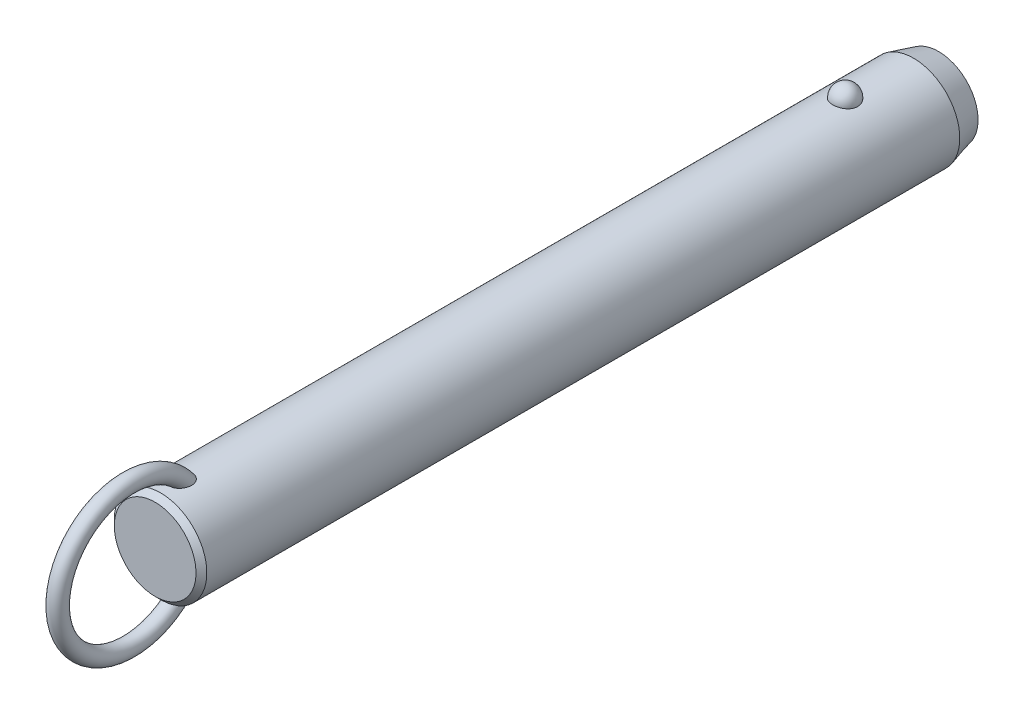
ISO-10303-21;
HEADER;
FILE_DESCRIPTION(('STEP AP214'),'2;1');
FILE_NAME('part.step','',(''),(''),'','','');
FILE_SCHEMA(('AUTOMOTIVE_DESIGN { 1 0 10303 214 1 1 1 1 }'));
ENDSEC;
DATA;
#1=APPLICATION_CONTEXT('core data for automotive mechanical design processes');
#2=APPLICATION_PROTOCOL_DEFINITION('international standard','automotive_design',2000,#1);
#3=PRODUCT_CONTEXT('',#1,'mechanical');
#4=PRODUCT('Part','Part','',(#3));
#5=PRODUCT_RELATED_PRODUCT_CATEGORY('part','',(#4));
#6=PRODUCT_DEFINITION_FORMATION('','',#4);
#7=PRODUCT_DEFINITION_CONTEXT('part definition',#1,'design');
#8=PRODUCT_DEFINITION('design','',#6,#7);
#9=PRODUCT_DEFINITION_SHAPE('','',#8);
#10=(LENGTH_UNIT() NAMED_UNIT(*) SI_UNIT(.MILLI.,.METRE.));
#11=(NAMED_UNIT(*) PLANE_ANGLE_UNIT() SI_UNIT($,.RADIAN.));
#12=(NAMED_UNIT(*) SI_UNIT($,.STERADIAN.) SOLID_ANGLE_UNIT());
#13=UNCERTAINTY_MEASURE_WITH_UNIT(LENGTH_MEASURE(1.E-05),#10,'distance_accuracy_value','');
#14=(GEOMETRIC_REPRESENTATION_CONTEXT(3) GLOBAL_UNCERTAINTY_ASSIGNED_CONTEXT((#13)) GLOBAL_UNIT_ASSIGNED_CONTEXT((#10,
#11,#12)) REPRESENTATION_CONTEXT('',''));
#15=CARTESIAN_POINT('',(0.,0.,0.));
#16=DIRECTION('',(0.,0.,1.));
#17=DIRECTION('',(1.,0.,0.));
#18=AXIS2_PLACEMENT_3D('',#15,#16,#17);
#19=CARTESIAN_POINT('',(0.,0.,149.9));
#20=DIRECTION('',(0.,0.,-1.));
#21=DIRECTION('',(-1.,0.,0.));
#22=AXIS2_PLACEMENT_3D('',#19,#20,#21);
#23=CYLINDRICAL_SURFACE('',#22,11.1);
#24=CARTESIAN_POINT('',(2.9724815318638,10.6945945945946,-2.99999999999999));
#25=CARTESIAN_POINT('',(2.97247830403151,10.6945972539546,-2.83225059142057));
#26=CARTESIAN_POINT('',(2.95876598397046,10.6984356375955,-2.66445972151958));
#27=CARTESIAN_POINT('',(2.90424529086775,10.7133624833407,-2.33362381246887));
#28=CARTESIAN_POINT('',(2.8634252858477,10.7244540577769,-2.17058084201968));
#29=CARTESIAN_POINT('',(2.75573657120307,10.7526272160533,-1.85396767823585));
#30=CARTESIAN_POINT('',(2.68887937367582,10.7697061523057,-1.70039333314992));
#31=CARTESIAN_POINT('',(2.53079696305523,10.8079438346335,-1.40691598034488));
#32=CARTESIAN_POINT('',(2.43957264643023,10.8291024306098,-1.26701246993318));
#33=CARTESIAN_POINT('',(2.23458150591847,10.8732541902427,-1.00409565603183));
#34=CARTESIAN_POINT('',(2.12071295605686,10.8962553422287,-0.881162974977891));
#35=CARTESIAN_POINT('',(1.87365402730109,10.9414421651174,-0.656352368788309));
#36=CARTESIAN_POINT('',(1.74046358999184,10.9636278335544,-0.55447450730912));
#37=CARTESIAN_POINT('',(1.45872188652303,11.0046495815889,-0.374872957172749));
#38=CARTESIAN_POINT('',(1.31021276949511,11.0234944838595,-0.297085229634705));
#39=CARTESIAN_POINT('',(1.00170030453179,11.0557957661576,-0.167529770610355));
#40=CARTESIAN_POINT('',(0.841698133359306,11.0692526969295,-0.115759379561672));
#41=CARTESIAN_POINT('',(0.517607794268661,11.0890932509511,-0.040392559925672));
#42=CARTESIAN_POINT('',(0.353633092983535,11.0955916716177,-0.0163383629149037));
#43=CARTESIAN_POINT('',(0.0238420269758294,11.1011989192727,0.00445177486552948));
#44=CARTESIAN_POINT('',(-0.141974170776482,11.1003084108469,0.00119017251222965));
#45=CARTESIAN_POINT('',(-0.468405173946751,11.0912990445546,-0.032323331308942));
#46=CARTESIAN_POINT('',(-0.629059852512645,11.0832767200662,-0.0622147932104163));
#47=CARTESIAN_POINT('',(-0.942937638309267,11.0609962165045,-0.147645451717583));
#48=CARTESIAN_POINT('',(-1.09616062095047,11.0467379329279,-0.20318507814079));
#49=CARTESIAN_POINT('',(-1.39181061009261,11.0134071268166,-0.338752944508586));
#50=CARTESIAN_POINT('',(-1.53417383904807,10.9943086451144,-0.418913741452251));
#51=CARTESIAN_POINT('',(-1.80342160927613,10.9533667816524,-0.601448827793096));
#52=CARTESIAN_POINT('',(-1.9303046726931,10.9315231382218,-0.703825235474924));
#53=CARTESIAN_POINT('',(-2.16747598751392,10.887005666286,-0.93009164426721));
#54=CARTESIAN_POINT('',(-2.27742774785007,10.8643239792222,-1.05433291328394));
#55=CARTESIAN_POINT('',(-2.47517316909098,10.8209886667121,-1.31966633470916));
#56=CARTESIAN_POINT('',(-2.56296538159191,10.8003351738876,-1.46075958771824));
#57=CARTESIAN_POINT('',(-2.71500300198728,10.7631304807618,-1.75753646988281));
#58=CARTESIAN_POINT('',(-2.77898901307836,10.7466250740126,-1.91335887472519));
#59=CARTESIAN_POINT('',(-2.88046189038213,10.7198747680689,-2.23391529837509));
#60=CARTESIAN_POINT('',(-2.91794947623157,10.709629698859,-2.39864907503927));
#61=CARTESIAN_POINT('',(-2.96537819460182,10.6965949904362,-2.73165170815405));
#62=CARTESIAN_POINT('',(-2.97542891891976,10.693775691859,-2.89990378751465));
#63=CARTESIAN_POINT('',(-2.96804271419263,10.6958279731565,-3.23575286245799));
#64=CARTESIAN_POINT('',(-2.95060646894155,10.7006993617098,-3.40334987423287));
#65=CARTESIAN_POINT('',(-2.88883358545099,10.71753912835,-3.73233906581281));
#66=CARTESIAN_POINT('',(-2.84462026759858,10.7294749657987,-3.893756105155));
#67=CARTESIAN_POINT('',(-2.73050447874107,10.7590797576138,-4.20667949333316));
#68=CARTESIAN_POINT('',(-2.66060103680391,10.7767489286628,-4.35818546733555));
#69=CARTESIAN_POINT('',(-2.49642559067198,10.8159599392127,-4.64785421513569));
#70=CARTESIAN_POINT('',(-2.40203047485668,10.8375211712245,-4.78594458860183));
#71=CARTESIAN_POINT('',(-2.19143488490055,10.8820570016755,-5.04410382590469));
#72=CARTESIAN_POINT('',(-2.07523364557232,10.9050316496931,-5.16417205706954));
#73=CARTESIAN_POINT('',(-1.82361254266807,10.9499219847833,-5.38334833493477));
#74=CARTESIAN_POINT('',(-1.68812945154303,10.9718338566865,-5.48238464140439));
#75=CARTESIAN_POINT('',(-1.40191298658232,11.0120611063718,-5.65618873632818));
#76=CARTESIAN_POINT('',(-1.25118062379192,11.0303767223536,-5.73095813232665));
#77=CARTESIAN_POINT('',(-0.940570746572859,11.0611653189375,-5.85334725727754));
#78=CARTESIAN_POINT('',(-0.780821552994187,11.0737044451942,-5.90127578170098));
#79=CARTESIAN_POINT('',(-0.455204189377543,11.0918598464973,-5.96992976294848));
#80=CARTESIAN_POINT('',(-0.289336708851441,11.0974768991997,-5.9906582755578));
#81=CARTESIAN_POINT('',(0.0406846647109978,11.1011307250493,-6.0041877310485));
#82=CARTESIAN_POINT('',(0.204817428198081,11.099299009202,-5.99747318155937));
#83=CARTESIAN_POINT('',(0.5295530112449,11.088551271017,-5.95740317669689));
#84=CARTESIAN_POINT('',(0.69015594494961,11.0796354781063,-5.92404858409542));
#85=CARTESIAN_POINT('',(1.0027760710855,11.0557204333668,-5.83180084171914));
#86=CARTESIAN_POINT('',(1.15482001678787,11.0407414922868,-5.77299291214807));
#87=CARTESIAN_POINT('',(1.44678373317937,11.0062913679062,-5.63147366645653));
#88=CARTESIAN_POINT('',(1.58670279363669,10.9868199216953,-5.548760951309));
#89=CARTESIAN_POINT('',(1.8527023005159,10.9451315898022,-5.36027644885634));
#90=CARTESIAN_POINT('',(1.97855158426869,10.9228788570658,-5.25418644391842));
#91=CARTESIAN_POINT('',(2.21080872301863,10.8782509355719,-5.02251354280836));
#92=CARTESIAN_POINT('',(2.31721312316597,10.8558757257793,-4.89692718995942));
#93=CARTESIAN_POINT('',(2.5094551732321,10.8130715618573,-4.62745408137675));
#94=CARTESIAN_POINT('',(2.59493284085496,10.7926798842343,-4.48330448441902));
#95=CARTESIAN_POINT('',(2.740862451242,10.7565495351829,-4.18236358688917));
#96=CARTESIAN_POINT('',(2.80132490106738,10.7408089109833,-4.02557762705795));
#97=CARTESIAN_POINT('',(2.88959070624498,10.7173718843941,-3.72475308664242));
#98=CARTESIAN_POINT('',(2.92062102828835,10.7088950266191,-3.58171216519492));
#99=CARTESIAN_POINT('',(2.96206765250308,10.6975052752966,-3.29245795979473));
#100=CARTESIAN_POINT('',(2.97248434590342,10.6945922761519,-3.14624473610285));
#101=CARTESIAN_POINT('',(2.9724815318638,10.6945945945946,-2.99999999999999));
#102=B_SPLINE_CURVE_WITH_KNOTS('',3,(#24,#25,#26,#27,#28,#29,#30,#31,#32,#33,#34,#35,#36,#37,
#38,#39,#40,#41,#42,#43,#44,#45,#46,#47,#48,#49,#50,#51,#52,#53,#54,#55,#56,#57,#58,#59,#60,#61,
#62,#63,#64,#65,#66,#67,#68,#69,#70,#71,#72,#73,#74,#75,#76,#77,#78,#79,#80,#81,#82,#83,#84,#85,
#86,#87,#88,#89,#90,#91,#92,#93,#94,#95,#96,#97,#98,#99,#100,#101),.UNSPECIFIED.,.T.,.F.,(4,2,2,
2,2,2,2,2,2,2,2,2,2,2,2,2,2,2,2,2,2,2,2,2,2,2,2,2,2,2,2,2,2,2,2,2,2,2,4),(0.,0.502722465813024,
1.00566079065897,1.5083769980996,2.01107471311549,2.51608392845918,3.02109467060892,
3.52475118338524,4.02835620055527,4.523518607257,5.0186364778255,5.50715297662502,
5.9956776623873,6.48688002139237,6.97812923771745,7.47814366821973,7.9781907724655,
8.48353712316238,8.9888697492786,9.49218093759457,9.99547960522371,10.4964777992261,
10.997494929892,11.5010810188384,12.0046847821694,12.5099796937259,13.0152411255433,
13.5145635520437,14.0138298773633,14.5043200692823,14.9947943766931,15.4836390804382,
15.9725123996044,16.4685040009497,16.9645836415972,17.4686765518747,17.972557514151,
18.410841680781,18.849117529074),.UNSPECIFIED.);
#103=CARTESIAN_POINT('',(2.9724815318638,10.6945945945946,-2.99999999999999));
#104=VERTEX_POINT('',#103);
#105=EDGE_CURVE('E41',#104,#104,#102,.T.);
#106=ORIENTED_EDGE('',*,*,#105,.T.);
#107=EDGE_LOOP('',(#106));
#108=FACE_BOUND('',#107,.T.);
#109=CARTESIAN_POINT('',(0.,0.,161.3));
#110=DIRECTION('',(0.,0.,1.));
#111=DIRECTION('',(1.,0.,0.));
#112=AXIS2_PLACEMENT_3D('',#109,#110,#111);
#113=CIRCLE('',#112,11.1);
#114=CARTESIAN_POINT('',(-11.1,0.,161.3));
#115=VERTEX_POINT('',#114);
#116=EDGE_CURVE('E10',#115,#115,#113,.F.);
#117=ORIENTED_EDGE('',*,*,#116,.T.);
#118=EDGE_LOOP('',(#117));
#119=FACE_BOUND('',#118,.T.);
#120=CARTESIAN_POINT('',(-0.564520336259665,-11.0856356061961,153.557815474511));
#121=CARTESIAN_POINT('',(-0.667202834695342,-11.0804062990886,153.591283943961));
#122=CARTESIAN_POINT('',(-0.766875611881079,-11.0738877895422,153.633835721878));
#123=CARTESIAN_POINT('',(-0.957284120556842,-11.0590576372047,153.735419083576));
#124=CARTESIAN_POINT('',(-1.04801616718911,-11.0507452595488,153.79445742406));
#125=CARTESIAN_POINT('',(-1.21800952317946,-11.0333016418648,153.926529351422));
#126=CARTESIAN_POINT('',(-1.29730805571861,-11.0241732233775,153.999515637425));
#127=CARTESIAN_POINT('',(-1.44337665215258,-11.0060026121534,154.157037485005));
#128=CARTESIAN_POINT('',(-1.51014622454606,-10.9969604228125,154.241573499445));
#129=CARTESIAN_POINT('',(-1.63454620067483,-10.9791841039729,154.425521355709));
#130=CARTESIAN_POINT('',(-1.69127003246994,-10.9705107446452,154.525549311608));
#131=CARTESIAN_POINT('',(-1.7898078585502,-10.9548648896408,154.732790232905));
#132=CARTESIAN_POINT('',(-1.83161214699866,-10.9478935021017,154.840007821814));
#133=CARTESIAN_POINT('',(-1.91557028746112,-10.9335803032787,155.105408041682));
#134=CARTESIAN_POINT('',(-1.95040620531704,-10.9273269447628,155.265980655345));
#135=CARTESIAN_POINT('',(-1.99388326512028,-10.9194709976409,155.590697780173));
#136=CARTESIAN_POINT('',(-2.00248051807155,-10.9178762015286,155.754847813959));
#137=CARTESIAN_POINT('',(-1.99551615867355,-10.9191578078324,156.124650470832));
#138=CARTESIAN_POINT('',(-1.9732206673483,-10.9232807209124,156.330191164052));
#139=CARTESIAN_POINT('',(-1.9152976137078,-10.9335244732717,156.633595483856));
#140=CARTESIAN_POINT('',(-1.89184575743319,-10.9376266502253,156.734088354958));
#141=CARTESIAN_POINT('',(-1.83700674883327,-10.9469720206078,156.932855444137));
#142=CARTESIAN_POINT('',(-1.80562070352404,-10.9522150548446,157.031129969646));
#143=CARTESIAN_POINT('',(-1.73463055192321,-10.9636837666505,157.225914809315));
#144=CARTESIAN_POINT('',(-1.69493416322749,-10.9699202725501,157.322390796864));
#145=CARTESIAN_POINT('',(-1.60745141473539,-10.9830806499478,157.511626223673));
#146=CARTESIAN_POINT('',(-1.55966150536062,-10.9900048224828,157.604384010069));
#147=CARTESIAN_POINT('',(-1.45591812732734,-11.0042280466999,157.784690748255));
#148=CARTESIAN_POINT('',(-1.40000013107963,-11.0115253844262,157.872260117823));
#149=CARTESIAN_POINT('',(-1.27937470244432,-11.0261911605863,158.041029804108));
#150=CARTESIAN_POINT('',(-1.21467835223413,-11.0335594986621,158.12223795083));
#151=CARTESIAN_POINT('',(-1.08218150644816,-11.0473027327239,158.269001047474));
#152=CARTESIAN_POINT('',(-1.01522633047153,-11.0537063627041,158.335309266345));
#153=CARTESIAN_POINT('',(-0.872952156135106,-11.065850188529,158.458378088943));
#154=CARTESIAN_POINT('',(-0.797642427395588,-11.0715911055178,158.515149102));
#155=CARTESIAN_POINT('',(-0.651396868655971,-11.081071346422,158.607515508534));
#156=CARTESIAN_POINT('',(-0.581712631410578,-11.0849841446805,158.645049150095));
#157=CARTESIAN_POINT('',(-0.437066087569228,-11.0916271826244,158.708259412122));
#158=CARTESIAN_POINT('',(-0.362109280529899,-11.0943586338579,158.733948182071));
#159=CARTESIAN_POINT('',(-0.207828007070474,-11.0983242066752,158.771117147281));
#160=CARTESIAN_POINT('',(-0.12846771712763,-11.0995432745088,158.782454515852));
#161=CARTESIAN_POINT('',(0.0309101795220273,-11.1002423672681,158.788965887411));
#162=CARTESIAN_POINT('',(0.110927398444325,-11.0997233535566,158.784148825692));
#163=CARTESIAN_POINT('',(0.25640659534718,-11.097240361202,158.760959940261));
#164=CARTESIAN_POINT('',(0.322235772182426,-11.0955074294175,158.744754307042));
#165=CARTESIAN_POINT('',(0.450635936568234,-11.0910350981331,158.702600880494));
#166=CARTESIAN_POINT('',(0.513205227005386,-11.0882951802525,158.676648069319));
#167=CARTESIAN_POINT('',(0.662626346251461,-11.0805620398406,158.602607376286));
#168=CARTESIAN_POINT('',(0.747127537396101,-11.0751144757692,158.549845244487));
#169=CARTESIAN_POINT('',(0.906756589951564,-11.0631932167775,158.431720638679));
#170=CARTESIAN_POINT('',(0.981859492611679,-11.0567168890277,158.366325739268));
#171=CARTESIAN_POINT('',(1.10712207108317,-11.0447856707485,158.24226337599));
#172=CARTESIAN_POINT('',(1.15909566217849,-11.0394280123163,158.185383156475));
#173=CARTESIAN_POINT('',(1.25791923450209,-11.0286040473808,158.067327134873));
#174=CARTESIAN_POINT('',(1.30476642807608,-11.0231376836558,158.006149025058));
#175=CARTESIAN_POINT('',(1.43818612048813,-11.0068027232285,157.817305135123));
#176=CARTESIAN_POINT('',(1.51751767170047,-10.9960104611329,157.684453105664));
#177=CARTESIAN_POINT('',(1.63597546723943,-10.9788847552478,157.453137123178));
#178=CARTESIAN_POINT('',(1.67988876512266,-10.9722190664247,157.357053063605));
#179=CARTESIAN_POINT('',(1.75953241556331,-10.9597298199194,157.161431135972));
#180=CARTESIAN_POINT('',(1.79525967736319,-10.9539065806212,157.061891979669));
#181=CARTESIAN_POINT('',(1.85844731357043,-10.9433632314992,156.86021118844));
#182=CARTESIAN_POINT('',(1.88591073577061,-10.9386427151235,156.75807052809));
#183=CARTESIAN_POINT('',(1.93234324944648,-10.9305350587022,156.551819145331));
#184=CARTESIAN_POINT('',(1.95131065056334,-10.9271481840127,156.447708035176));
#185=CARTESIAN_POINT('',(1.9904020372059,-10.9201183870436,156.165458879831));
#186=CARTESIAN_POINT('',(2.00221217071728,-10.9179256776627,155.986037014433));
#187=CARTESIAN_POINT('',(1.99711676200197,-10.9188636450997,155.627713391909));
#188=CARTESIAN_POINT('',(1.98026150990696,-10.9219849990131,155.448811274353));
#189=CARTESIAN_POINT('',(1.92151657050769,-10.9324473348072,155.13645144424));
#190=CARTESIAN_POINT('',(1.88605081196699,-10.9386915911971,155.001759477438));
#191=CARTESIAN_POINT('',(1.79393020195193,-10.9541780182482,154.739966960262));
#192=CARTESIAN_POINT('',(1.73729868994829,-10.9634168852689,154.612858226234));
#193=CARTESIAN_POINT('',(1.61237037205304,-10.9824218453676,154.389418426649));
#194=CARTESIAN_POINT('',(1.54715374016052,-10.9918945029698,154.291345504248));
#195=CARTESIAN_POINT('',(1.40127026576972,-11.0114415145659,154.107434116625));
#196=CARTESIAN_POINT('',(1.32060742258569,-11.0215157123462,154.021592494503));
#197=CARTESIAN_POINT('',(1.1447478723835,-11.041168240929,153.865163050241));
#198=CARTESIAN_POINT('',(1.04947805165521,-11.0507437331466,153.794656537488));
#199=CARTESIAN_POINT('',(0.847278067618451,-11.0680789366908,153.672640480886));
#200=CARTESIAN_POINT('',(0.740351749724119,-11.0758392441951,153.621124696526));
#201=CARTESIAN_POINT('',(0.529289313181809,-11.0878275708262,153.543485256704));
#202=CARTESIAN_POINT('',(0.425895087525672,-11.0923259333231,153.515377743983));
#203=CARTESIAN_POINT('',(0.215723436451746,-11.0984001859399,153.477703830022));
#204=CARTESIAN_POINT('',(0.10894793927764,-11.0999777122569,153.468127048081));
#205=CARTESIAN_POINT('',(-0.0938962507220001,-11.1000196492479,153.467877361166));
#206=CARTESIAN_POINT('',(-0.189967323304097,-11.0987797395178,153.475408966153));
#207=CARTESIAN_POINT('',(-0.379657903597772,-11.0939111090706,153.505507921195));
#208=CARTESIAN_POINT('',(-0.473277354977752,-11.0902823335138,153.528075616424));
#209=CARTESIAN_POINT('',(-0.564520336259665,-11.0856356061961,153.557815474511));
#210=B_SPLINE_CURVE_WITH_KNOTS('',3,(#120,#121,#122,#123,#124,#125,#126,#127,#128,#129,#130,
#131,#132,#133,#134,#135,#136,#137,#138,#139,#140,#141,#142,#143,#144,#145,#146,#147,#148,#149,
#150,#151,#152,#153,#154,#155,#156,#157,#158,#159,#160,#161,#162,#163,#164,#165,#166,#167,#168,
#169,#170,#171,#172,#173,#174,#175,#176,#177,#178,#179,#180,#181,#182,#183,#184,#185,#186,#187,
#188,#189,#190,#191,#192,#193,#194,#195,#196,#197,#198,#199,#200,#201,#202,#203,#204,#205,#206,
#207,#208,#209),.UNSPECIFIED.,.T.,.F.,(4,2,2,2,2,2,2,2,2,2,2,2,2,2,2,2,2,2,2,2,2,2,2,2,2,2,2,2,
2,2,2,2,2,2,2,2,2,2,2,2,2,2,2,2,4),(0.,0.323999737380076,0.648132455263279,0.971184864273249,
1.29424994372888,1.63886237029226,1.98369857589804,2.47426059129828,2.96564271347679,
3.58257396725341,3.89215258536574,4.20168803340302,4.51486273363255,4.82817514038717,
5.14015911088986,5.45175282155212,5.73442856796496,6.01679375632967,6.25364580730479,
6.49025437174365,6.72919963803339,6.96801276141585,7.17061258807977,7.37331685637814,
7.67094989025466,7.96935728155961,8.20075067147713,8.43226927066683,8.89581623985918,
9.21306533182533,9.5304340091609,9.84768549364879,10.1650000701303,10.7022930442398,
11.2386443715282,11.655339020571,12.071575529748,12.4245637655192,12.7774607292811,
13.1321855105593,13.4867936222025,13.8068771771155,14.1267813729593,14.4146787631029,
14.7025827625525),.UNSPECIFIED.);
#211=CARTESIAN_POINT('',(-0.564520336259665,-11.0856356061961,153.557815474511));
#212=VERTEX_POINT('',#211);
#213=EDGE_CURVE('E60',#212,#212,#210,.T.);
#214=ORIENTED_EDGE('',*,*,#213,.T.);
#215=EDGE_LOOP('',(#214));
#216=FACE_BOUND('',#215,.T.);
#217=CARTESIAN_POINT('',(-0.564520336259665,11.0856356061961,153.557815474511));
#218=CARTESIAN_POINT('',(-0.468542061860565,11.0905203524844,153.526545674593));
#219=CARTESIAN_POINT('',(-0.369793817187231,11.0942886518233,153.503157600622));
#220=CARTESIAN_POINT('',(-0.169555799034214,11.0991586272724,153.473085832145));
#221=CARTESIAN_POINT('',(-0.0680604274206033,11.1002543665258,153.46643932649));
#222=CARTESIAN_POINT('',(0.13454973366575,11.099646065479,153.470157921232));
#223=CARTESIAN_POINT('',(0.235664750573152,11.0979441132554,153.48051033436));
#224=CARTESIAN_POINT('',(0.434632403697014,11.0919342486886,153.517831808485));
#225=CARTESIAN_POINT('',(0.532486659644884,11.0876276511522,153.544792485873));
#226=CARTESIAN_POINT('',(0.722445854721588,11.0768742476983,153.6144096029));
#227=CARTESIAN_POINT('',(0.814543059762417,11.0704246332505,153.657086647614));
#228=CARTESIAN_POINT('',(0.990565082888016,11.0560659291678,153.756648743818));
#229=CARTESIAN_POINT('',(1.07448844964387,11.048156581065,153.813536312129));
#230=CARTESIAN_POINT('',(1.23562672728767,11.0313221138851,153.942210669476));
#231=CARTESIAN_POINT('',(1.3124268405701,11.0223686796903,154.014511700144));
#232=CARTESIAN_POINT('',(1.45398030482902,11.0045918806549,154.170042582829));
#233=CARTESIAN_POINT('',(1.51873073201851,10.9957685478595,154.253275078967));
#234=CARTESIAN_POINT('',(1.64107232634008,10.9782087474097,154.436384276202));
#235=CARTESIAN_POINT('',(1.6974317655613,10.9695572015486,154.537089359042));
#236=CARTESIAN_POINT('',(1.79515063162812,10.9539887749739,154.745626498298));
#237=CARTESIAN_POINT('',(1.83649966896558,10.9470730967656,154.85346343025));
#238=CARTESIAN_POINT('',(1.91931148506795,10.9329211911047,155.120399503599));
#239=CARTESIAN_POINT('',(1.95340104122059,10.9267904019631,155.281861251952));
#240=CARTESIAN_POINT('',(1.99526195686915,10.9192174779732,155.60821631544));
#241=CARTESIAN_POINT('',(2.00298989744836,10.9177830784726,155.77311484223));
#242=CARTESIAN_POINT('',(1.99396251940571,10.9194420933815,156.144100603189));
#243=CARTESIAN_POINT('',(1.97050829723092,10.923774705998,156.35003871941));
#244=CARTESIAN_POINT('',(1.91079643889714,10.9343131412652,156.653901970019));
#245=CARTESIAN_POINT('',(1.88673702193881,10.9385106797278,156.754529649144));
#246=CARTESIAN_POINT('',(1.83065508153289,10.9480376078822,156.953510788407));
#247=CARTESIAN_POINT('',(1.79863369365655,10.9533668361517,157.051864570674));
#248=CARTESIAN_POINT('',(1.72633365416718,10.9649954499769,157.246720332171));
#249=CARTESIAN_POINT('',(1.68596409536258,10.9713053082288,157.34318790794));
#250=CARTESIAN_POINT('',(1.59707998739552,10.9845964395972,157.532323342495));
#251=CARTESIAN_POINT('',(1.54856169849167,10.9915780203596,157.624989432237));
#252=CARTESIAN_POINT('',(1.44330168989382,11.0058935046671,157.804975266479));
#253=CARTESIAN_POINT('',(1.3865974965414,11.0132257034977,157.892316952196));
#254=CARTESIAN_POINT('',(1.2643115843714,11.0279330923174,158.060456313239));
#255=CARTESIAN_POINT('',(1.19874160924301,11.0353082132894,158.141262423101));
#256=CARTESIAN_POINT('',(1.06542088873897,11.048931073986,158.285985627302));
#257=CARTESIAN_POINT('',(0.998640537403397,11.0552153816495,158.350784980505));
#258=CARTESIAN_POINT('',(0.856896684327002,11.0671032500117,158.470846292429));
#259=CARTESIAN_POINT('',(0.781942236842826,11.0727075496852,158.526118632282));
#260=CARTESIAN_POINT('',(0.636276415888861,11.081949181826,158.615972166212));
#261=CARTESIAN_POINT('',(0.566755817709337,11.0857572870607,158.652441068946));
#262=CARTESIAN_POINT('',(0.422602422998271,11.0921860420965,158.713533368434));
#263=CARTESIAN_POINT('',(0.347974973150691,11.0948079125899,158.738168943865));
#264=CARTESIAN_POINT('',(0.194593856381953,11.0985608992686,158.773323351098));
#265=CARTESIAN_POINT('',(0.115807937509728,11.0996777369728,158.783706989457));
#266=CARTESIAN_POINT('',(-0.0422499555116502,11.1002003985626,158.788574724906));
#267=CARTESIAN_POINT('',(-0.121521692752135,11.09960699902,158.783066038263));
#268=CARTESIAN_POINT('',(-0.266046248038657,11.0970123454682,158.758827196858));
#269=CARTESIAN_POINT('',(-0.331661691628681,11.0952283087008,158.742135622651));
#270=CARTESIAN_POINT('',(-0.45958809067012,11.0906663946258,158.699111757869));
#271=CARTESIAN_POINT('',(-0.52189737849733,11.0878880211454,158.672774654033));
#272=CARTESIAN_POINT('',(-0.671446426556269,11.0800342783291,158.597513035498));
#273=CARTESIAN_POINT('',(-0.756250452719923,11.0744969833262,158.543818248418));
#274=CARTESIAN_POINT('',(-0.916349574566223,11.0624045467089,158.423802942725));
#275=CARTESIAN_POINT('',(-0.991618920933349,11.0558467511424,158.357449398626));
#276=CARTESIAN_POINT('',(-1.11713140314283,11.0437783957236,158.231633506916));
#277=CARTESIAN_POINT('',(-1.16920539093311,11.0383619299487,158.173952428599));
#278=CARTESIAN_POINT('',(-1.26817476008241,11.02743010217,158.054280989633));
#279=CARTESIAN_POINT('',(-1.31506731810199,11.0219146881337,157.992288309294));
#280=CARTESIAN_POINT('',(-1.40399813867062,11.0109399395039,157.864784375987));
#281=CARTESIAN_POINT('',(-1.44602864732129,11.0054807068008,157.799267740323));
#282=CARTESIAN_POINT('',(-1.52538779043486,10.9947621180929,157.665422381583));
#283=CARTESIAN_POINT('',(-1.56271516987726,10.9895028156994,157.597092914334));
#284=CARTESIAN_POINT('',(-1.64537943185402,10.9774790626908,157.433210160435));
#285=CARTESIAN_POINT('',(-1.68879497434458,10.9708503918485,157.3366735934));
#286=CARTESIAN_POINT('',(-1.76740738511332,10.9584602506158,157.140236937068));
#287=CARTESIAN_POINT('',(-1.80260120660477,10.95269910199,157.04033561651));
#288=CARTESIAN_POINT('',(-1.86468657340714,10.9423003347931,156.837966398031));
#289=CARTESIAN_POINT('',(-1.8915816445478,10.9376622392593,156.735499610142));
#290=CARTESIAN_POINT('',(-1.93682458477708,10.9297405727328,156.528642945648));
#291=CARTESIAN_POINT('',(-1.95517082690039,10.9264572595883,156.424252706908));
#292=CARTESIAN_POINT('',(-1.99232562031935,10.9197647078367,156.14262876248));
#293=CARTESIAN_POINT('',(-2.00294603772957,10.9177914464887,155.964185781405));
#294=CARTESIAN_POINT('',(-1.99566675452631,10.9191290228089,155.607996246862));
#295=CARTESIAN_POINT('',(-1.97781651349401,10.9224306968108,155.43024902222));
#296=CARTESIAN_POINT('',(-1.91747214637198,10.93315926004,155.119792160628));
#297=CARTESIAN_POINT('',(-1.88131022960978,10.9395108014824,154.985825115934));
#298=CARTESIAN_POINT('',(-1.78790380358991,10.9551659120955,154.72559757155));
#299=CARTESIAN_POINT('',(-1.7306830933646,10.9644661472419,154.599328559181));
#300=CARTESIAN_POINT('',(-1.60475573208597,10.9835398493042,154.37741565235));
#301=CARTESIAN_POINT('',(-1.53908879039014,10.9930297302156,154.280026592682));
#302=CARTESIAN_POINT('',(-1.39238608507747,11.0125708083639,154.097525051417));
#303=CARTESIAN_POINT('',(-1.31135150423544,11.0226219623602,154.012411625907));
#304=CARTESIAN_POINT('',(-1.14382035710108,11.0411991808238,153.86529943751));
#305=CARTESIAN_POINT('',(-1.0585850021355,11.0497792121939,153.80186930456));
#306=CARTESIAN_POINT('',(-0.878723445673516,11.0655285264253,153.690250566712));
#307=CARTESIAN_POINT('',(-0.784123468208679,11.0727015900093,153.642020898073));
#308=CARTESIAN_POINT('',(-0.646163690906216,11.0812501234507,153.586023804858));
#309=CARTESIAN_POINT('',(-0.605595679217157,11.0835451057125,153.571197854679));
#310=CARTESIAN_POINT('',(-0.564520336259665,11.0856356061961,153.557815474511));
#311=B_SPLINE_CURVE_WITH_KNOTS('',3,(#217,#218,#219,#220,#221,#222,#223,#224,#225,#226,#227,
#228,#229,#230,#231,#232,#233,#234,#235,#236,#237,#238,#239,#240,#241,#242,#243,#244,#245,#246,
#247,#248,#249,#250,#251,#252,#253,#254,#255,#256,#257,#258,#259,#260,#261,#262,#263,#264,#265,
#266,#267,#268,#269,#270,#271,#272,#273,#274,#275,#276,#277,#278,#279,#280,#281,#282,#283,#284,
#285,#286,#287,#288,#289,#290,#291,#292,#293,#294,#295,#296,#297,#298,#299,#300,#301,#302,#303,
#304,#305,#306,#307,#308,#309,#310),.UNSPECIFIED.,.T.,.F.,(4,2,2,2,2,2,2,2,2,2,2,2,2,2,2,2,2,2,
2,2,2,2,2,2,2,2,2,2,2,2,2,2,2,2,2,2,2,2,2,2,2,2,2,2,2,2,4),(0.,0.303061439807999,
0.606795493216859,0.910302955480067,1.21365733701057,1.51741085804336,1.82121821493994,
2.13745205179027,2.45376252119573,2.79958678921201,3.14564996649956,3.63832391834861,
4.13180893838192,4.75031912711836,5.06071926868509,5.37107516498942,5.68500772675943,
5.99908475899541,6.31176519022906,6.62403542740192,6.90315673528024,7.18197194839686,
7.41687778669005,7.65154134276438,7.88841587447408,8.12518286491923,8.32752842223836,
8.52997509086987,8.82986421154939,9.13054668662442,9.36393502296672,9.59744991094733,
9.83133221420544,10.0652767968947,10.383032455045,10.7009056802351,11.0186436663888,
11.3364420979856,11.8705925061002,12.4038159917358,12.8189662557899,13.2336487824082,
13.5857049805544,13.9377340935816,14.2561354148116,14.5736690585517,14.7033687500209),.UNSPECIFIED.);
#312=CARTESIAN_POINT('',(-0.564520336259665,11.0856356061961,153.557815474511));
#313=VERTEX_POINT('',#312);
#314=EDGE_CURVE('E68',#313,#313,#311,.T.);
#315=ORIENTED_EDGE('',*,*,#314,.T.);
#316=EDGE_LOOP('',(#315));
#317=FACE_BOUND('',#316,.T.);
#318=CARTESIAN_POINT('',(0.,0.,-19.3999999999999));
#319=DIRECTION('',(0.,0.,-1.));
#320=DIRECTION('',(-1.,0.,0.));
#321=AXIS2_PLACEMENT_3D('',#318,#319,#320);
#322=CIRCLE('',#321,11.1);
#323=CARTESIAN_POINT('',(-11.1,0.,-19.3999999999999));
#324=VERTEX_POINT('',#323);
#325=EDGE_CURVE('E57',#324,#324,#322,.F.);
#326=ORIENTED_EDGE('',*,*,#325,.T.);
#327=EDGE_LOOP('',(#326));
#328=FACE_BOUND('',#327,.T.);
#329=ADVANCED_FACE('F37',(#108,#119,#216,#317,#328),#23,.T.);
#330=CARTESIAN_POINT('',(0.,0.,-25.4));
#331=DIRECTION('',(0.,0.,-1.));
#332=DIRECTION('',(-1.,0.,0.));
#333=AXIS2_PLACEMENT_3D('',#330,#331,#332);
#334=PLANE('',#333);
#335=CARTESIAN_POINT('',(0.,0.,-25.4));
#336=DIRECTION('',(0.,0.,-1.));
#337=DIRECTION('',(-1.,0.,0.));
#338=AXIS2_PLACEMENT_3D('',#335,#336,#337);
#339=CIRCLE('',#338,9.49230484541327);
#340=CARTESIAN_POINT('',(-9.49230484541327,0.,-25.4));
#341=VERTEX_POINT('',#340);
#342=EDGE_CURVE('E67',#341,#341,#339,.T.);
#343=ORIENTED_EDGE('',*,*,#342,.T.);
#344=EDGE_LOOP('',(#343));
#345=FACE_BOUND('',#344,.T.);
#346=ADVANCED_FACE('F86',(#345),#334,.T.);
#347=CARTESIAN_POINT('',(0.,0.,-25.4));
#348=DIRECTION('',(0.,0.,1.));
#349=DIRECTION('',(1.,0.,0.));
#350=AXIS2_PLACEMENT_3D('',#347,#348,#349);
#351=CONICAL_SURFACE('',#350,9.49230484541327,0.261799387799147);
#352=ORIENTED_EDGE('',*,*,#325,.F.);
#353=EDGE_LOOP('',(#352));
#354=FACE_BOUND('',#353,.T.);
#355=ORIENTED_EDGE('',*,*,#342,.F.);
#356=EDGE_LOOP('',(#355));
#357=FACE_BOUND('',#356,.T.);
#358=ADVANCED_FACE('F84',(#354,#357),#351,.T.);
#359=CARTESIAN_POINT('',(0.,0.,162.6));
#360=DIRECTION('',(0.,0.,1.));
#361=DIRECTION('',(1.,0.,0.));
#362=AXIS2_PLACEMENT_3D('',#359,#360,#361);
#363=PLANE('',#362);
#364=CARTESIAN_POINT('',(0.,0.,162.6));
#365=DIRECTION('',(0.,0.,1.));
#366=DIRECTION('',(1.,0.,0.));
#367=AXIS2_PLACEMENT_3D('',#364,#365,#366);
#368=CIRCLE('',#367,9.8);
#369=CARTESIAN_POINT('',(-9.80000000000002,0.,162.6));
#370=VERTEX_POINT('',#369);
#371=EDGE_CURVE('E50',#370,#370,#368,.T.);
#372=ORIENTED_EDGE('',*,*,#371,.T.);
#373=EDGE_LOOP('',(#372));
#374=FACE_BOUND('',#373,.T.);
#375=ADVANCED_FACE('F78',(#374),#363,.T.);
#376=CARTESIAN_POINT('',(0.,0.,168.95));
#377=DIRECTION('',(1.,0.,0.));
#378=DIRECTION('',(0.,0.,-1.));
#379=AXIS2_PLACEMENT_3D('',#376,#377,#378);
#380=TOROIDAL_SURFACE('',#379,17.05,2.);
#381=ORIENTED_EDGE('',*,*,#314,.F.);
#382=EDGE_LOOP('',(#381));
#383=FACE_BOUND('',#382,.T.);
#384=ORIENTED_EDGE('',*,*,#213,.F.);
#385=EDGE_LOOP('',(#384));
#386=FACE_BOUND('',#385,.T.);
#387=ADVANCED_FACE('F74',(#383,#386),#380,.T.);
#388=CARTESIAN_POINT('',(0.,0.,162.6));
#389=DIRECTION('',(0.,0.,-1.));
#390=DIRECTION('',(-1.,0.,0.));
#391=AXIS2_PLACEMENT_3D('',#388,#389,#390);
#392=CONICAL_SURFACE('',#391,9.8,0.785398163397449);
#393=CARTESIAN_POINT('',(-11.1,0.,161.3));
#394=CARTESIAN_POINT('',(-11.0864583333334,0.,161.313541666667));
#395=CARTESIAN_POINT('',(-11.0729166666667,0.,161.327083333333));
#396=CARTESIAN_POINT('',(-11.0458333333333,0.,161.354166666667));
#397=CARTESIAN_POINT('',(-11.0322916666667,0.,161.367708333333));
#398=CARTESIAN_POINT('',(-11.0052083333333,0.,161.394791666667));
#399=CARTESIAN_POINT('',(-10.9916666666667,0.,161.408333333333));
#400=CARTESIAN_POINT('',(-10.9645833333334,0.,161.435416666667));
#401=CARTESIAN_POINT('',(-10.9510416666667,0.,161.448958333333));
#402=CARTESIAN_POINT('',(-10.9239583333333,0.,161.476041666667));
#403=CARTESIAN_POINT('',(-10.9104166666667,0.,161.489583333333));
#404=CARTESIAN_POINT('',(-10.8833333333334,0.,161.516666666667));
#405=CARTESIAN_POINT('',(-10.8697916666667,0.,161.530208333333));
#406=CARTESIAN_POINT('',(-10.8427083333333,0.,161.557291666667));
#407=CARTESIAN_POINT('',(-10.8291666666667,0.,161.570833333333));
#408=CARTESIAN_POINT('',(-10.8020833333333,0.,161.597916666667));
#409=CARTESIAN_POINT('',(-10.7885416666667,0.,161.611458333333));
#410=CARTESIAN_POINT('',(-10.7614583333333,0.,161.638541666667));
#411=CARTESIAN_POINT('',(-10.7479166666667,0.,161.652083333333));
#412=CARTESIAN_POINT('',(-10.7208333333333,0.,161.679166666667));
#413=CARTESIAN_POINT('',(-10.7072916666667,0.,161.692708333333));
#414=CARTESIAN_POINT('',(-10.6802083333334,0.,161.719791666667));
#415=CARTESIAN_POINT('',(-10.6666666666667,0.,161.733333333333));
#416=CARTESIAN_POINT('',(-10.6395833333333,0.,161.760416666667));
#417=CARTESIAN_POINT('',(-10.6260416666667,0.,161.773958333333));
#418=CARTESIAN_POINT('',(-10.5989583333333,0.,161.801041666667));
#419=CARTESIAN_POINT('',(-10.5854166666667,0.,161.814583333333));
#420=CARTESIAN_POINT('',(-10.5583333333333,0.,161.841666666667));
#421=CARTESIAN_POINT('',(-10.5447916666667,0.,161.855208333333));
#422=CARTESIAN_POINT('',(-10.5177083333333,0.,161.882291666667));
#423=CARTESIAN_POINT('',(-10.5041666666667,0.,161.895833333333));
#424=CARTESIAN_POINT('',(-10.4770833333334,0.,161.922916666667));
#425=CARTESIAN_POINT('',(-10.4635416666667,0.,161.936458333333));
#426=CARTESIAN_POINT('',(-10.4364583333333,0.,161.963541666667));
#427=CARTESIAN_POINT('',(-10.4229166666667,0.,161.977083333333));
#428=CARTESIAN_POINT('',(-10.3958333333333,0.,162.004166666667));
#429=CARTESIAN_POINT('',(-10.3822916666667,0.,162.017708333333));
#430=CARTESIAN_POINT('',(-10.3552083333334,0.,162.044791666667));
#431=CARTESIAN_POINT('',(-10.3416666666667,0.,162.058333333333));
#432=CARTESIAN_POINT('',(-10.3145833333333,0.,162.085416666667));
#433=CARTESIAN_POINT('',(-10.3010416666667,0.,162.098958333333));
#434=CARTESIAN_POINT('',(-10.2739583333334,0.,162.126041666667));
#435=CARTESIAN_POINT('',(-10.2604166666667,0.,162.139583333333));
#436=CARTESIAN_POINT('',(-10.2333333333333,0.,162.166666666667));
#437=CARTESIAN_POINT('',(-10.2197916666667,0.,162.180208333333));
#438=CARTESIAN_POINT('',(-10.1927083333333,0.,162.207291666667));
#439=CARTESIAN_POINT('',(-10.1791666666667,0.,162.220833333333));
#440=CARTESIAN_POINT('',(-10.1520833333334,0.,162.247916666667));
#441=CARTESIAN_POINT('',(-10.1385416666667,0.,162.261458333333));
#442=CARTESIAN_POINT('',(-10.1114583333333,0.,162.288541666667));
#443=CARTESIAN_POINT('',(-10.0979166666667,0.,162.302083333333));
#444=CARTESIAN_POINT('',(-10.0708333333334,0.,162.329166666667));
#445=CARTESIAN_POINT('',(-10.0572916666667,0.,162.342708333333));
#446=CARTESIAN_POINT('',(-10.0302083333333,0.,162.369791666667));
#447=CARTESIAN_POINT('',(-10.0166666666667,0.,162.383333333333));
#448=CARTESIAN_POINT('',(-9.98958333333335,0.,162.410416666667));
#449=CARTESIAN_POINT('',(-9.97604166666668,0.,162.423958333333));
#450=CARTESIAN_POINT('',(-9.94895833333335,0.,162.451041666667));
#451=CARTESIAN_POINT('',(-9.93541666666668,0.,162.464583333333));
#452=CARTESIAN_POINT('',(-9.90833333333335,0.,162.491666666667));
#453=CARTESIAN_POINT('',(-9.89479166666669,0.,162.505208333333));
#454=CARTESIAN_POINT('',(-9.86770833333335,0.,162.532291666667));
#455=CARTESIAN_POINT('',(-9.85416666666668,0.,162.545833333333));
#456=CARTESIAN_POINT('',(-9.82708333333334,0.,162.572916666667));
#457=CARTESIAN_POINT('',(-9.81354166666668,0.,162.586458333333));
#458=CARTESIAN_POINT('',(-9.80000000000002,0.,162.6));
#459=B_SPLINE_CURVE_WITH_KNOTS('',3,(#393,#394,#395,#396,#397,#398,#399,#400,#401,#402,#403,
#404,#405,#406,#407,#408,#409,#410,#411,#412,#413,#414,#415,#416,#417,#418,#419,#420,#421,#422,
#423,#424,#425,#426,#427,#428,#429,#430,#431,#432,#433,#434,#435,#436,#437,#438,#439,#440,#441,
#442,#443,#444,#445,#446,#447,#448,#449,#450,#451,#452,#453,#454,#455,#456,#457,#458),
.UNSPECIFIED.,.F.,.F.,(4,2,2,2,2,2,2,2,2,2,2,2,2,2,2,2,2,2,2,2,2,2,2,2,2,2,2,2,2,2,2,2,4),(0.,
0.0574524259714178,0.114904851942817,0.172357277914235,0.229809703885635,0.287262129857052,
0.344714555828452,0.40216698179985,0.459619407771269,0.517071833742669,0.574524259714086,
0.631976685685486,0.689429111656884,0.746881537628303,0.804333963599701,0.86178638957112,
0.919238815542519,0.976691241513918,1.03414366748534,1.09159609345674,1.14904851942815,
1.20650094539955,1.26395337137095,1.32140579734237,1.37885822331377,1.43631064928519,
1.49376307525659,1.55121550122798,1.6086679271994,1.6661203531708,1.72357277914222,
1.78102520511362,1.83847763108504),.UNSPECIFIED.);
#460=EDGE_CURVE('BSEAM39',#115,#370,#459,.T.);
#461=ORIENTED_EDGE('',*,*,#116,.F.);
#462=ORIENTED_EDGE('',*,*,#371,.F.);
#463=ORIENTED_EDGE('',*,*,#460,.T.);
#464=ORIENTED_EDGE('',*,*,#460,.F.);
#465=EDGE_LOOP('',(#461,#463,#462,#464));
#466=FACE_BOUND('',#465,.T.);
#467=ADVANCED_FACE('F39',(#466),#392,.T.);
#468=CARTESIAN_POINT('',(0.,11.1,-2.99999999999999));
#469=DIRECTION('',(0.,1.,0.));
#470=DIRECTION('',(0.,0.,-1.));
#471=AXIS2_PLACEMENT_3D('',#468,#469,#470);
#472=SPHERICAL_SURFACE('',#471,3.);
#473=ORIENTED_EDGE('',*,*,#105,.F.);
#474=EDGE_LOOP('',(#473));
#475=FACE_BOUND('',#474,.T.);
#476=ADVANCED_FACE('F80',(#475),#472,.T.);
#477=CLOSED_SHELL('',(#329,#346,#358,#375,#387,#467,#476));
#478=MANIFOLD_SOLID_BREP('B2',#477);
#479=ADVANCED_BREP_SHAPE_REPRESENTATION('',(#18,#478),#14);
#480=SHAPE_DEFINITION_REPRESENTATION(#9,#479);
ENDSEC;
END-ISO-10303-21;
